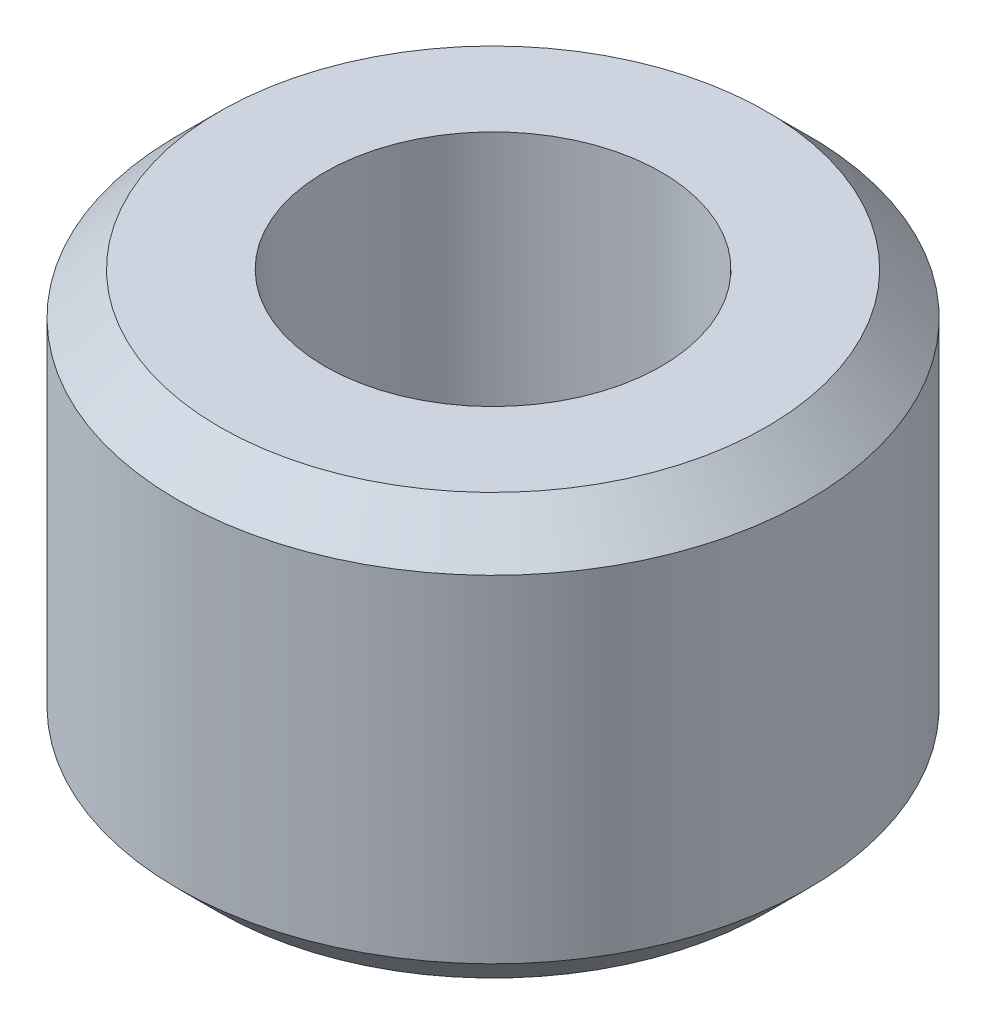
from build123d import *

# Parameters (mm, degrees)
SKETCH1_R           = 7.5
SKETCH1_R_2         = 4
BOSS_EXTRUDE1_DEPTH = 10
CHAMFER1_SIZE       = 1


with BuildPart() as part:
    # Sketch1 → Boss-Extrude1 (new body)
    with BuildSketch(Plane(origin=(0, 0, 0), x_dir=(1, 0, 0), z_dir=(0, 1, 0))):
        with Locations(Location((0, 0, 0), (0, 0, 270))):
            Circle(SKETCH1_R)
        with Locations(Location((0, 0, 0), (0, 0, 270))):
            Circle(SKETCH1_R_2, mode=Mode.SUBTRACT)
    extrude(amount=BOSS_EXTRUDE1_DEPTH)

    # Chamfer1
    chamfer1_edges = [part.edges().sort_by_distance(p)[0] for p in [
        (0, 0, -7.5),
        (0, 10, -7.5),
    ]]
    chamfer(chamfer1_edges, length=CHAMFER1_SIZE)


solid = part.part
